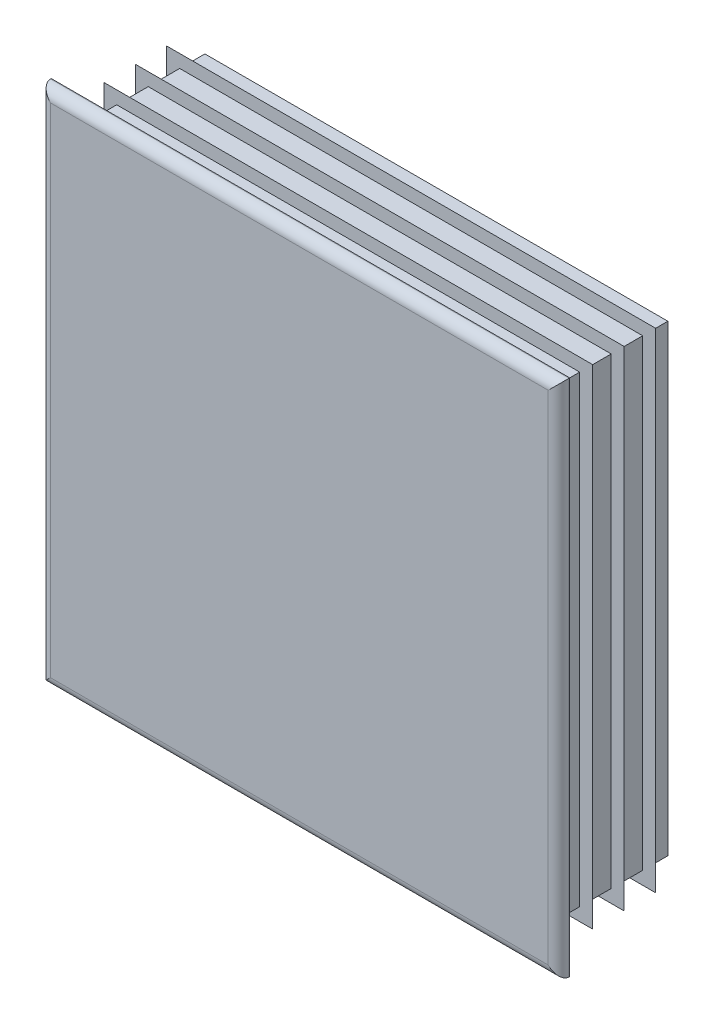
ISO-10303-21;
HEADER;
FILE_DESCRIPTION(('STEP AP214'),'2;1');
FILE_NAME('part.step','',(''),(''),'','','');
FILE_SCHEMA(('AUTOMOTIVE_DESIGN { 1 0 10303 214 1 1 1 1 }'));
ENDSEC;
DATA;
#1=APPLICATION_CONTEXT('core data for automotive mechanical design processes');
#2=APPLICATION_PROTOCOL_DEFINITION('international standard','automotive_design',2000,#1);
#3=PRODUCT_CONTEXT('',#1,'mechanical');
#4=PRODUCT('Part','Part','',(#3));
#5=PRODUCT_RELATED_PRODUCT_CATEGORY('part','',(#4));
#6=PRODUCT_DEFINITION_FORMATION('','',#4);
#7=PRODUCT_DEFINITION_CONTEXT('part definition',#1,'design');
#8=PRODUCT_DEFINITION('design','',#6,#7);
#9=PRODUCT_DEFINITION_SHAPE('','',#8);
#10=(LENGTH_UNIT() NAMED_UNIT(*) SI_UNIT(.MILLI.,.METRE.));
#11=(NAMED_UNIT(*) PLANE_ANGLE_UNIT() SI_UNIT($,.RADIAN.));
#12=(NAMED_UNIT(*) SI_UNIT($,.STERADIAN.) SOLID_ANGLE_UNIT());
#13=UNCERTAINTY_MEASURE_WITH_UNIT(LENGTH_MEASURE(1.E-05),#10,'distance_accuracy_value','');
#14=(GEOMETRIC_REPRESENTATION_CONTEXT(3) GLOBAL_UNCERTAINTY_ASSIGNED_CONTEXT((#13)) GLOBAL_UNIT_ASSIGNED_CONTEXT((#10,
#11,#12)) REPRESENTATION_CONTEXT('',''));
#15=CARTESIAN_POINT('',(0.,0.,0.));
#16=DIRECTION('',(0.,0.,1.));
#17=DIRECTION('',(1.,0.,0.));
#18=AXIS2_PLACEMENT_3D('',#15,#16,#17);
#19=CARTESIAN_POINT('',(67.2,-70.,3.));
#20=DIRECTION('',(0.,0.,-1.));
#21=DIRECTION('',(0.,1.,0.));
#22=AXIS2_PLACEMENT_3D('',#19,#20,#21);
#23=PLANE('',#22);
#24=DIRECTION('',(0.,1.,0.));
#25=VECTOR('',#24,1.);
#26=CARTESIAN_POINT('',(-67.2,-70.,3.));
#27=LINE('',#26,#25);
#28=CARTESIAN_POINT('',(-67.2,-67.2,3.));
#29=VERTEX_POINT('',#28);
#30=CARTESIAN_POINT('',(-67.2,67.2,3.));
#31=VERTEX_POINT('',#30);
#32=EDGE_CURVE('E262',#29,#31,#27,.T.);
#33=ORIENTED_EDGE('',*,*,#32,.F.);
#34=DIRECTION('',(-1.,0.,0.));
#35=VECTOR('',#34,1.);
#36=CARTESIAN_POINT('',(70.,-67.2,3.));
#37=LINE('',#36,#35);
#38=CARTESIAN_POINT('',(67.2,-67.2,3.));
#39=VERTEX_POINT('',#38);
#40=EDGE_CURVE('E432',#39,#29,#37,.T.);
#41=ORIENTED_EDGE('',*,*,#40,.F.);
#42=DIRECTION('',(0.,1.,0.));
#43=VECTOR('',#42,1.);
#44=CARTESIAN_POINT('',(67.2,-70.,3.));
#45=LINE('',#44,#43);
#46=CARTESIAN_POINT('',(67.2,67.2,3.));
#47=VERTEX_POINT('',#46);
#48=EDGE_CURVE('E257',#39,#47,#45,.T.);
#49=ORIENTED_EDGE('',*,*,#48,.T.);
#50=DIRECTION('',(-1.,0.,0.));
#51=VECTOR('',#50,1.);
#52=CARTESIAN_POINT('',(70.,67.2,3.));
#53=LINE('',#52,#51);
#54=EDGE_CURVE('E534',#47,#31,#53,.T.);
#55=ORIENTED_EDGE('',*,*,#54,.T.);
#56=EDGE_LOOP('',(#33,#41,#49,#55));
#57=FACE_BOUND('',#56,.T.);
#58=ADVANCED_FACE('F14',(#57),#23,.F.);
#59=CARTESIAN_POINT('',(-67.2,-70.,0.199999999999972));
#60=DIRECTION('',(0.,1.,0.));
#61=DIRECTION('',(-1.,0.,0.));
#62=AXIS2_PLACEMENT_3D('',#59,#60,#61);
#63=CYLINDRICAL_SURFACE('',#62,2.8);
#64=DIRECTION('',(0.,1.,0.));
#65=VECTOR('',#64,1.);
#66=CARTESIAN_POINT('',(-70.,-70.,0.2));
#67=LINE('',#66,#65);
#68=CARTESIAN_POINT('',(-70.,-70.,0.2));
#69=VERTEX_POINT('',#68);
#70=CARTESIAN_POINT('',(-70.,70.,0.2));
#71=VERTEX_POINT('',#70);
#72=EDGE_CURVE('E354',#69,#71,#67,.T.);
#73=ORIENTED_EDGE('',*,*,#72,.F.);
#74=CARTESIAN_POINT('',(-67.2,-67.2,0.199999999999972));
#75=DIRECTION('',(-0.707106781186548,0.707106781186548,0.));
#76=DIRECTION('',(0.707106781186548,0.707106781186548,0.));
#77=AXIS2_PLACEMENT_3D('',#74,#75,#76);
#78=ELLIPSE('',#77,3.9597979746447,2.8);
#79=EDGE_CURVE('E59',#69,#29,#78,.T.);
#80=ORIENTED_EDGE('',*,*,#79,.T.);
#81=ORIENTED_EDGE('',*,*,#32,.T.);
#82=CARTESIAN_POINT('',(-67.2,67.2,0.199999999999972));
#83=DIRECTION('',(0.707106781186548,0.707106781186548,0.));
#84=DIRECTION('',(-0.707106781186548,0.707106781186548,0.));
#85=AXIS2_PLACEMENT_3D('',#82,#83,#84);
#86=ELLIPSE('',#85,3.9597979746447,2.8);
#87=EDGE_CURVE('E258',#31,#71,#86,.F.);
#88=ORIENTED_EDGE('',*,*,#87,.T.);
#89=EDGE_LOOP('',(#73,#80,#81,#88));
#90=FACE_BOUND('',#89,.T.);
#91=ADVANCED_FACE('F16',(#90),#63,.T.);
#92=CARTESIAN_POINT('',(-70.,-70.,0.2));
#93=DIRECTION('',(1.,0.,0.));
#94=DIRECTION('',(0.,1.,0.));
#95=AXIS2_PLACEMENT_3D('',#92,#93,#94);
#96=PLANE('',#95);
#97=DIRECTION('',(0.,0.,-1.));
#98=VECTOR('',#97,1.);
#99=CARTESIAN_POINT('',(-70.,70.,0.2));
#100=LINE('',#99,#98);
#101=CARTESIAN_POINT('',(-70.,70.,0.));
#102=VERTEX_POINT('',#101);
#103=EDGE_CURVE('E519',#71,#102,#100,.T.);
#104=ORIENTED_EDGE('',*,*,#103,.T.);
#105=DIRECTION('',(0.,1.,0.));
#106=VECTOR('',#105,1.);
#107=CARTESIAN_POINT('',(-70.,-70.,0.));
#108=LINE('',#107,#106);
#109=CARTESIAN_POINT('',(-70.,-70.,0.));
#110=VERTEX_POINT('',#109);
#111=EDGE_CURVE('E352',#110,#102,#108,.T.);
#112=ORIENTED_EDGE('',*,*,#111,.F.);
#113=DIRECTION('',(0.,0.,-1.));
#114=VECTOR('',#113,1.);
#115=CARTESIAN_POINT('',(-70.,-70.,0.2));
#116=LINE('',#115,#114);
#117=EDGE_CURVE('E520',#69,#110,#116,.T.);
#118=ORIENTED_EDGE('',*,*,#117,.F.);
#119=ORIENTED_EDGE('',*,*,#72,.T.);
#120=EDGE_LOOP('',(#104,#112,#118,#119));
#121=FACE_BOUND('',#120,.T.);
#122=ADVANCED_FACE('F604',(#121),#96,.F.);
#123=CARTESIAN_POINT('',(-62.5,-70.,0.));
#124=DIRECTION('',(1.,0.,0.));
#125=DIRECTION('',(0.,1.,0.));
#126=AXIS2_PLACEMENT_3D('',#123,#124,#125);
#127=PLANE('',#126);
#128=DIRECTION('',(0.,1.,0.));
#129=VECTOR('',#128,1.);
#130=CARTESIAN_POINT('',(-62.5,-70.,0.));
#131=LINE('',#130,#129);
#132=CARTESIAN_POINT('',(-62.5,-62.5,0.));
#133=VERTEX_POINT('',#132);
#134=CARTESIAN_POINT('',(-62.5,62.5,0.));
#135=VERTEX_POINT('',#134);
#136=EDGE_CURVE('E349',#133,#135,#131,.T.);
#137=ORIENTED_EDGE('',*,*,#136,.T.);
#138=DIRECTION('',(0.,0.,-1.));
#139=VECTOR('',#138,1.);
#140=CARTESIAN_POINT('',(-62.5,62.5,0.));
#141=LINE('',#140,#139);
#142=CARTESIAN_POINT('',(-62.5,62.5,-1.7));
#143=VERTEX_POINT('',#142);
#144=EDGE_CURVE('E445',#135,#143,#141,.T.);
#145=ORIENTED_EDGE('',*,*,#144,.T.);
#146=DIRECTION('',(0.,1.,0.));
#147=VECTOR('',#146,1.);
#148=CARTESIAN_POINT('',(-62.5,-70.,-1.7));
#149=LINE('',#148,#147);
#150=CARTESIAN_POINT('',(-62.5,-62.5,-1.7));
#151=VERTEX_POINT('',#150);
#152=EDGE_CURVE('E346',#151,#143,#149,.T.);
#153=ORIENTED_EDGE('',*,*,#152,.F.);
#154=DIRECTION('',(0.,0.,1.));
#155=VECTOR('',#154,1.);
#156=CARTESIAN_POINT('',(-62.5,-62.5,0.));
#157=LINE('',#156,#155);
#158=EDGE_CURVE('E439',#151,#133,#157,.T.);
#159=ORIENTED_EDGE('',*,*,#158,.T.);
#160=EDGE_LOOP('',(#137,#145,#153,#159));
#161=FACE_BOUND('',#160,.T.);
#162=ADVANCED_FACE('F728',(#161),#127,.F.);
#163=CARTESIAN_POINT('',(-66.,-70.,-1.7));
#164=DIRECTION('',(0.573576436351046,0.,0.819152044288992));
#165=DIRECTION('',(-0.819152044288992,0.,0.573576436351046));
#166=AXIS2_PLACEMENT_3D('',#163,#164,#165);
#167=PLANE('',#166);
#168=DIRECTION('',(0.,1.,0.));
#169=VECTOR('',#168,1.);
#170=CARTESIAN_POINT('',(-66.,-70.,-1.7));
#171=LINE('',#170,#169);
#172=CARTESIAN_POINT('',(-66.,-66.,-1.7));
#173=VERTEX_POINT('',#172);
#174=CARTESIAN_POINT('',(-66.,66.,-1.7));
#175=VERTEX_POINT('',#174);
#176=EDGE_CURVE('E344',#173,#175,#171,.T.);
#177=ORIENTED_EDGE('',*,*,#176,.T.);
#178=DIRECTION('',(0.633687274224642,-0.633687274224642,-0.443712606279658));
#179=VECTOR('',#178,1.);
#180=CARTESIAN_POINT('',(-11.3878996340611,11.3878996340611,-39.9398043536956));
#181=LINE('',#180,#179);
#182=CARTESIAN_POINT('',(-62.5,62.5,-4.15072638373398));
#183=VERTEX_POINT('',#182);
#184=EDGE_CURVE('E457',#175,#183,#181,.T.);
#185=ORIENTED_EDGE('',*,*,#184,.T.);
#186=DIRECTION('',(0.,1.,0.));
#187=VECTOR('',#186,1.);
#188=CARTESIAN_POINT('',(-62.5,-70.,-4.15072638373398));
#189=LINE('',#188,#187);
#190=CARTESIAN_POINT('',(-62.5,-62.5,-4.15072638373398));
#191=VERTEX_POINT('',#190);
#192=EDGE_CURVE('E341',#191,#183,#189,.T.);
#193=ORIENTED_EDGE('',*,*,#192,.F.);
#194=DIRECTION('',(-0.633687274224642,-0.633687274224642,0.443712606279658));
#195=VECTOR('',#194,1.);
#196=CARTESIAN_POINT('',(-67.606238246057,-67.606238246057,-0.575299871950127));
#197=LINE('',#196,#195);
#198=EDGE_CURVE('E451',#191,#173,#197,.T.);
#199=ORIENTED_EDGE('',*,*,#198,.T.);
#200=EDGE_LOOP('',(#177,#185,#193,#199));
#201=FACE_BOUND('',#200,.T.);
#202=ADVANCED_FACE('F732',(#201),#167,.F.);
#203=CARTESIAN_POINT('',(-62.5,-70.,-4.15072638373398));
#204=DIRECTION('',(1.,0.,0.));
#205=DIRECTION('',(0.,1.,0.));
#206=AXIS2_PLACEMENT_3D('',#203,#204,#205);
#207=PLANE('',#206);
#208=ORIENTED_EDGE('',*,*,#192,.T.);
#209=DIRECTION('',(0.,0.,-1.));
#210=VECTOR('',#209,1.);
#211=CARTESIAN_POINT('',(-62.5,62.5,-4.15072638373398));
#212=LINE('',#211,#210);
#213=CARTESIAN_POINT('',(-62.5,62.5,-10.2));
#214=VERTEX_POINT('',#213);
#215=EDGE_CURVE('E463',#183,#214,#212,.T.);
#216=ORIENTED_EDGE('',*,*,#215,.T.);
#217=DIRECTION('',(0.,1.,0.));
#218=VECTOR('',#217,1.);
#219=CARTESIAN_POINT('',(-62.5,-70.,-10.2));
#220=LINE('',#219,#218);
#221=CARTESIAN_POINT('',(-62.5,-62.5,-10.2));
#222=VERTEX_POINT('',#221);
#223=EDGE_CURVE('E338',#222,#214,#220,.T.);
#224=ORIENTED_EDGE('',*,*,#223,.F.);
#225=DIRECTION('',(0.,0.,1.));
#226=VECTOR('',#225,1.);
#227=CARTESIAN_POINT('',(-62.5,-62.5,-4.15072638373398));
#228=LINE('',#227,#226);
#229=EDGE_CURVE('E460',#222,#191,#228,.T.);
#230=ORIENTED_EDGE('',*,*,#229,.T.);
#231=EDGE_LOOP('',(#208,#216,#224,#230));
#232=FACE_BOUND('',#231,.T.);
#233=ADVANCED_FACE('F738',(#232),#207,.F.);
#234=CARTESIAN_POINT('',(-66.,-70.,-10.2));
#235=DIRECTION('',(0.573576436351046,0.,0.819152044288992));
#236=DIRECTION('',(-0.819152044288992,0.,0.573576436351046));
#237=AXIS2_PLACEMENT_3D('',#234,#235,#236);
#238=PLANE('',#237);
#239=DIRECTION('',(0.,1.,0.));
#240=VECTOR('',#239,1.);
#241=CARTESIAN_POINT('',(-66.,-70.,-10.2));
#242=LINE('',#241,#240);
#243=CARTESIAN_POINT('',(-66.,-66.,-10.2));
#244=VERTEX_POINT('',#243);
#245=CARTESIAN_POINT('',(-66.,66.,-10.2));
#246=VERTEX_POINT('',#245);
#247=EDGE_CURVE('E336',#244,#246,#242,.T.);
#248=ORIENTED_EDGE('',*,*,#247,.T.);
#249=DIRECTION('',(0.633687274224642,-0.633687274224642,-0.443712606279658));
#250=VECTOR('',#249,1.);
#251=CARTESIAN_POINT('',(-11.3878996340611,11.3878996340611,-48.4398043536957));
#252=LINE('',#251,#250);
#253=CARTESIAN_POINT('',(-62.5,62.5,-12.650726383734));
#254=VERTEX_POINT('',#253);
#255=EDGE_CURVE('E475',#246,#254,#252,.T.);
#256=ORIENTED_EDGE('',*,*,#255,.T.);
#257=DIRECTION('',(0.,1.,0.));
#258=VECTOR('',#257,1.);
#259=CARTESIAN_POINT('',(-62.5,-70.,-12.650726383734));
#260=LINE('',#259,#258);
#261=CARTESIAN_POINT('',(-62.5,-62.5,-12.650726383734));
#262=VERTEX_POINT('',#261);
#263=EDGE_CURVE('E333',#262,#254,#260,.T.);
#264=ORIENTED_EDGE('',*,*,#263,.F.);
#265=DIRECTION('',(-0.633687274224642,-0.633687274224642,0.443712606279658));
#266=VECTOR('',#265,1.);
#267=CARTESIAN_POINT('',(-67.606238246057,-67.606238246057,-9.07529987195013));
#268=LINE('',#267,#266);
#269=EDGE_CURVE('E469',#262,#244,#268,.T.);
#270=ORIENTED_EDGE('',*,*,#269,.T.);
#271=EDGE_LOOP('',(#248,#256,#264,#270));
#272=FACE_BOUND('',#271,.T.);
#273=ADVANCED_FACE('F742',(#272),#238,.F.);
#274=CARTESIAN_POINT('',(-62.5,-70.,-12.650726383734));
#275=DIRECTION('',(1.,0.,0.));
#276=DIRECTION('',(0.,1.,0.));
#277=AXIS2_PLACEMENT_3D('',#274,#275,#276);
#278=PLANE('',#277);
#279=ORIENTED_EDGE('',*,*,#263,.T.);
#280=DIRECTION('',(0.,0.,-1.));
#281=VECTOR('',#280,1.);
#282=CARTESIAN_POINT('',(-62.5,62.5,-12.650726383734));
#283=LINE('',#282,#281);
#284=CARTESIAN_POINT('',(-62.5,62.5,-18.7));
#285=VERTEX_POINT('',#284);
#286=EDGE_CURVE('E481',#254,#285,#283,.T.);
#287=ORIENTED_EDGE('',*,*,#286,.T.);
#288=DIRECTION('',(0.,1.,0.));
#289=VECTOR('',#288,1.);
#290=CARTESIAN_POINT('',(-62.5,-70.,-18.7));
#291=LINE('',#290,#289);
#292=CARTESIAN_POINT('',(-62.5,-62.5,-18.7));
#293=VERTEX_POINT('',#292);
#294=EDGE_CURVE('E330',#293,#285,#291,.T.);
#295=ORIENTED_EDGE('',*,*,#294,.F.);
#296=DIRECTION('',(0.,0.,1.));
#297=VECTOR('',#296,1.);
#298=CARTESIAN_POINT('',(-62.5,-62.5,-12.650726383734));
#299=LINE('',#298,#297);
#300=EDGE_CURVE('E478',#293,#262,#299,.T.);
#301=ORIENTED_EDGE('',*,*,#300,.T.);
#302=EDGE_LOOP('',(#279,#287,#295,#301));
#303=FACE_BOUND('',#302,.T.);
#304=ADVANCED_FACE('F746',(#303),#278,.F.);
#305=CARTESIAN_POINT('',(-66.,-70.,-18.7));
#306=DIRECTION('',(0.573576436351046,0.,0.819152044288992));
#307=DIRECTION('',(-0.819152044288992,0.,0.573576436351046));
#308=AXIS2_PLACEMENT_3D('',#305,#306,#307);
#309=PLANE('',#308);
#310=DIRECTION('',(0.,1.,0.));
#311=VECTOR('',#310,1.);
#312=CARTESIAN_POINT('',(-66.,-70.,-18.7));
#313=LINE('',#312,#311);
#314=CARTESIAN_POINT('',(-66.,-66.,-18.7));
#315=VERTEX_POINT('',#314);
#316=CARTESIAN_POINT('',(-66.,66.,-18.7));
#317=VERTEX_POINT('',#316);
#318=EDGE_CURVE('E328',#315,#317,#313,.T.);
#319=ORIENTED_EDGE('',*,*,#318,.T.);
#320=DIRECTION('',(0.633687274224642,-0.633687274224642,-0.443712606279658));
#321=VECTOR('',#320,1.);
#322=CARTESIAN_POINT('',(-11.3878996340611,11.3878996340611,-56.9398043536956));
#323=LINE('',#322,#321);
#324=CARTESIAN_POINT('',(-62.5,62.5,-21.150726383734));
#325=VERTEX_POINT('',#324);
#326=EDGE_CURVE('E493',#317,#325,#323,.T.);
#327=ORIENTED_EDGE('',*,*,#326,.T.);
#328=DIRECTION('',(0.,1.,0.));
#329=VECTOR('',#328,1.);
#330=CARTESIAN_POINT('',(-62.5,-70.,-21.150726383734));
#331=LINE('',#330,#329);
#332=CARTESIAN_POINT('',(-62.5,-62.5,-21.150726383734));
#333=VERTEX_POINT('',#332);
#334=EDGE_CURVE('E325',#333,#325,#331,.T.);
#335=ORIENTED_EDGE('',*,*,#334,.F.);
#336=DIRECTION('',(-0.633687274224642,-0.633687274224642,0.443712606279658));
#337=VECTOR('',#336,1.);
#338=CARTESIAN_POINT('',(-67.606238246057,-67.606238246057,-17.5752998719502));
#339=LINE('',#338,#337);
#340=EDGE_CURVE('E487',#333,#315,#339,.T.);
#341=ORIENTED_EDGE('',*,*,#340,.T.);
#342=EDGE_LOOP('',(#319,#327,#335,#341));
#343=FACE_BOUND('',#342,.T.);
#344=ADVANCED_FACE('F668',(#343),#309,.F.);
#345=CARTESIAN_POINT('',(-62.5,-70.,-21.150726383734));
#346=DIRECTION('',(1.,0.,0.));
#347=DIRECTION('',(0.,1.,0.));
#348=AXIS2_PLACEMENT_3D('',#345,#346,#347);
#349=PLANE('',#348);
#350=ORIENTED_EDGE('',*,*,#334,.T.);
#351=DIRECTION('',(0.,0.,-1.));
#352=VECTOR('',#351,1.);
#353=CARTESIAN_POINT('',(-62.5,62.5,-21.150726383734));
#354=LINE('',#353,#352);
#355=CARTESIAN_POINT('',(-62.5,62.5,-27.2));
#356=VERTEX_POINT('',#355);
#357=EDGE_CURVE('E499',#325,#356,#354,.T.);
#358=ORIENTED_EDGE('',*,*,#357,.T.);
#359=DIRECTION('',(0.,1.,0.));
#360=VECTOR('',#359,1.);
#361=CARTESIAN_POINT('',(-62.5,-70.,-27.2));
#362=LINE('',#361,#360);
#363=CARTESIAN_POINT('',(-62.5,-62.5,-27.2));
#364=VERTEX_POINT('',#363);
#365=EDGE_CURVE('E322',#364,#356,#362,.T.);
#366=ORIENTED_EDGE('',*,*,#365,.F.);
#367=DIRECTION('',(0.,0.,1.));
#368=VECTOR('',#367,1.);
#369=CARTESIAN_POINT('',(-62.5,-62.5,-21.150726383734));
#370=LINE('',#369,#368);
#371=EDGE_CURVE('E496',#364,#333,#370,.T.);
#372=ORIENTED_EDGE('',*,*,#371,.T.);
#373=EDGE_LOOP('',(#350,#358,#366,#372));
#374=FACE_BOUND('',#373,.T.);
#375=ADVANCED_FACE('F665',(#374),#349,.F.);
#376=CARTESIAN_POINT('',(-66.,-70.,-27.2));
#377=DIRECTION('',(0.573576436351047,0.,0.819152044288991));
#378=DIRECTION('',(-0.819152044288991,0.,0.573576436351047));
#379=AXIS2_PLACEMENT_3D('',#376,#377,#378);
#380=PLANE('',#379);
#381=DIRECTION('',(0.,1.,0.));
#382=VECTOR('',#381,1.);
#383=CARTESIAN_POINT('',(-66.,-70.,-27.2));
#384=LINE('',#383,#382);
#385=CARTESIAN_POINT('',(-66.,-66.,-27.2));
#386=VERTEX_POINT('',#385);
#387=CARTESIAN_POINT('',(-66.,66.,-27.2));
#388=VERTEX_POINT('',#387);
#389=EDGE_CURVE('E320',#386,#388,#384,.T.);
#390=ORIENTED_EDGE('',*,*,#389,.T.);
#391=DIRECTION('',(0.633687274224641,-0.633687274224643,-0.443712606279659));
#392=VECTOR('',#391,1.);
#393=CARTESIAN_POINT('',(-11.3878996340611,11.3878996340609,-65.4398043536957));
#394=LINE('',#393,#392);
#395=CARTESIAN_POINT('',(-62.5,62.5,-29.650726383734));
#396=VERTEX_POINT('',#395);
#397=EDGE_CURVE('E511',#388,#396,#394,.T.);
#398=ORIENTED_EDGE('',*,*,#397,.T.);
#399=DIRECTION('',(0.,1.,0.));
#400=VECTOR('',#399,1.);
#401=CARTESIAN_POINT('',(-62.5,-70.,-29.650726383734));
#402=LINE('',#401,#400);
#403=CARTESIAN_POINT('',(-62.5,-62.5,-29.650726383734));
#404=VERTEX_POINT('',#403);
#405=EDGE_CURVE('E317',#404,#396,#402,.T.);
#406=ORIENTED_EDGE('',*,*,#405,.F.);
#407=DIRECTION('',(-0.633687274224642,-0.633687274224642,0.443712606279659));
#408=VECTOR('',#407,1.);
#409=CARTESIAN_POINT('',(-67.606238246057,-67.606238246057,-26.0752998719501));
#410=LINE('',#409,#408);
#411=EDGE_CURVE('E505',#404,#386,#410,.T.);
#412=ORIENTED_EDGE('',*,*,#411,.T.);
#413=EDGE_LOOP('',(#390,#398,#406,#412));
#414=FACE_BOUND('',#413,.T.);
#415=ADVANCED_FACE('F580',(#414),#380,.F.);
#416=CARTESIAN_POINT('',(-62.5,-70.,-29.650726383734));
#417=DIRECTION('',(1.,0.,0.));
#418=DIRECTION('',(0.,1.,0.));
#419=AXIS2_PLACEMENT_3D('',#416,#417,#418);
#420=PLANE('',#419);
#421=ORIENTED_EDGE('',*,*,#405,.T.);
#422=DIRECTION('',(0.,0.,-1.));
#423=VECTOR('',#422,1.);
#424=CARTESIAN_POINT('',(-62.5,62.5,-29.650726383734));
#425=LINE('',#424,#423);
#426=CARTESIAN_POINT('',(-62.5,62.5,-34.));
#427=VERTEX_POINT('',#426);
#428=EDGE_CURVE('E517',#396,#427,#425,.T.);
#429=ORIENTED_EDGE('',*,*,#428,.T.);
#430=DIRECTION('',(0.,1.,0.));
#431=VECTOR('',#430,1.);
#432=CARTESIAN_POINT('',(-62.5,-70.,-34.));
#433=LINE('',#432,#431);
#434=CARTESIAN_POINT('',(-62.5,-62.5,-34.));
#435=VERTEX_POINT('',#434);
#436=EDGE_CURVE('E314',#435,#427,#433,.T.);
#437=ORIENTED_EDGE('',*,*,#436,.F.);
#438=DIRECTION('',(0.,0.,1.));
#439=VECTOR('',#438,1.);
#440=CARTESIAN_POINT('',(-62.5,-62.5,-29.650726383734));
#441=LINE('',#440,#439);
#442=EDGE_CURVE('E514',#435,#404,#441,.T.);
#443=ORIENTED_EDGE('',*,*,#442,.T.);
#444=EDGE_LOOP('',(#421,#429,#437,#443));
#445=FACE_BOUND('',#444,.T.);
#446=ADVANCED_FACE('F582',(#445),#420,.F.);
#447=CARTESIAN_POINT('',(-62.5,-70.,-34.));
#448=DIRECTION('',(0.,0.,1.));
#449=DIRECTION('',(0.,-1.,0.));
#450=AXIS2_PLACEMENT_3D('',#447,#448,#449);
#451=PLANE('',#450);
#452=ORIENTED_EDGE('',*,*,#436,.T.);
#453=DIRECTION('',(-1.,0.,0.));
#454=VECTOR('',#453,1.);
#455=CARTESIAN_POINT('',(70.,62.5,-34.));
#456=LINE('',#455,#454);
#457=CARTESIAN_POINT('',(62.5,62.5,-34.));
#458=VERTEX_POINT('',#457);
#459=EDGE_CURVE('E388',#458,#427,#456,.T.);
#460=ORIENTED_EDGE('',*,*,#459,.F.);
#461=DIRECTION('',(0.,1.,0.));
#462=VECTOR('',#461,1.);
#463=CARTESIAN_POINT('',(62.5,-70.,-34.));
#464=LINE('',#463,#462);
#465=CARTESIAN_POINT('',(62.5,-62.5,-34.));
#466=VERTEX_POINT('',#465);
#467=EDGE_CURVE('E311',#466,#458,#464,.T.);
#468=ORIENTED_EDGE('',*,*,#467,.F.);
#469=DIRECTION('',(-1.,0.,0.));
#470=VECTOR('',#469,1.);
#471=CARTESIAN_POINT('',(70.,-62.5,-34.));
#472=LINE('',#471,#470);
#473=EDGE_CURVE('E386',#466,#435,#472,.T.);
#474=ORIENTED_EDGE('',*,*,#473,.T.);
#475=EDGE_LOOP('',(#452,#460,#468,#474));
#476=FACE_BOUND('',#475,.T.);
#477=ADVANCED_FACE('F385',(#476),#451,.F.);
#478=CARTESIAN_POINT('',(62.5,-70.,-34.));
#479=DIRECTION('',(-1.,0.,0.));
#480=DIRECTION('',(0.,-1.,0.));
#481=AXIS2_PLACEMENT_3D('',#478,#479,#480);
#482=PLANE('',#481);
#483=ORIENTED_EDGE('',*,*,#467,.T.);
#484=DIRECTION('',(0.,0.,1.));
#485=VECTOR('',#484,1.);
#486=CARTESIAN_POINT('',(62.5,62.5,-34.));
#487=LINE('',#486,#485);
#488=CARTESIAN_POINT('',(62.5,62.5,-29.650726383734));
#489=VERTEX_POINT('',#488);
#490=EDGE_CURVE('E9',#458,#489,#487,.T.);
#491=ORIENTED_EDGE('',*,*,#490,.T.);
#492=DIRECTION('',(0.,1.,0.));
#493=VECTOR('',#492,1.);
#494=CARTESIAN_POINT('',(62.5,-70.,-29.650726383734));
#495=LINE('',#494,#493);
#496=CARTESIAN_POINT('',(62.5,-62.5,-29.650726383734));
#497=VERTEX_POINT('',#496);
#498=EDGE_CURVE('E308',#497,#489,#495,.T.);
#499=ORIENTED_EDGE('',*,*,#498,.F.);
#500=DIRECTION('',(0.,0.,-1.));
#501=VECTOR('',#500,1.);
#502=CARTESIAN_POINT('',(62.5,-62.5,-34.));
#503=LINE('',#502,#501);
#504=EDGE_CURVE('E23',#497,#466,#503,.T.);
#505=ORIENTED_EDGE('',*,*,#504,.T.);
#506=EDGE_LOOP('',(#483,#491,#499,#505));
#507=FACE_BOUND('',#506,.T.);
#508=ADVANCED_FACE('F378',(#507),#482,.F.);
#509=CARTESIAN_POINT('',(62.5,-70.,-29.650726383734));
#510=DIRECTION('',(-0.573576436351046,0.,0.819152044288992));
#511=DIRECTION('',(-0.819152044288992,0.,-0.573576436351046));
#512=AXIS2_PLACEMENT_3D('',#509,#510,#511);
#513=PLANE('',#512);
#514=ORIENTED_EDGE('',*,*,#498,.T.);
#515=DIRECTION('',(0.633687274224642,0.633687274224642,0.443712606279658));
#516=VECTOR('',#515,1.);
#517=CARTESIAN_POINT('',(9.29335809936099,9.29335809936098,-66.906418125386));
#518=LINE('',#517,#516);
#519=CARTESIAN_POINT('',(66.,66.,-27.2));
#520=VERTEX_POINT('',#519);
#521=EDGE_CURVE('E508',#489,#520,#518,.T.);
#522=ORIENTED_EDGE('',*,*,#521,.T.);
#523=DIRECTION('',(0.,1.,0.));
#524=VECTOR('',#523,1.);
#525=CARTESIAN_POINT('',(66.,-70.,-27.2));
#526=LINE('',#525,#524);
#527=CARTESIAN_POINT('',(66.,-66.,-27.2));
#528=VERTEX_POINT('',#527);
#529=EDGE_CURVE('E305',#528,#520,#526,.T.);
#530=ORIENTED_EDGE('',*,*,#529,.F.);
#531=DIRECTION('',(-0.633687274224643,0.633687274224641,-0.443712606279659));
#532=VECTOR('',#531,1.);
#533=CARTESIAN_POINT('',(65.5116967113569,-65.5116967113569,-27.5419136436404));
#534=LINE('',#533,#532);
#535=EDGE_CURVE('E502',#528,#497,#534,.T.);
#536=ORIENTED_EDGE('',*,*,#535,.T.);
#537=EDGE_LOOP('',(#514,#522,#530,#536));
#538=FACE_BOUND('',#537,.T.);
#539=ADVANCED_FACE('F588',(#538),#513,.F.);
#540=CARTESIAN_POINT('',(66.,-70.,-27.2));
#541=DIRECTION('',(0.,0.,-1.));
#542=DIRECTION('',(0.,1.,0.));
#543=AXIS2_PLACEMENT_3D('',#540,#541,#542);
#544=PLANE('',#543);
#545=ORIENTED_EDGE('',*,*,#529,.T.);
#546=DIRECTION('',(-1.,0.,0.));
#547=VECTOR('',#546,1.);
#548=CARTESIAN_POINT('',(70.,66.,-27.2));
#549=LINE('',#548,#547);
#550=EDGE_CURVE('E394',#520,#388,#549,.T.);
#551=ORIENTED_EDGE('',*,*,#550,.T.);
#552=ORIENTED_EDGE('',*,*,#389,.F.);
#553=DIRECTION('',(-1.,0.,0.));
#554=VECTOR('',#553,1.);
#555=CARTESIAN_POINT('',(70.,-66.,-27.2));
#556=LINE('',#555,#554);
#557=EDGE_CURVE('E401',#528,#386,#556,.T.);
#558=ORIENTED_EDGE('',*,*,#557,.F.);
#559=EDGE_LOOP('',(#545,#551,#552,#558));
#560=FACE_BOUND('',#559,.T.);
#561=ORIENTED_EDGE('',*,*,#365,.T.);
#562=DIRECTION('',(-1.,0.,0.));
#563=VECTOR('',#562,1.);
#564=CARTESIAN_POINT('',(70.,62.5,-27.2));
#565=LINE('',#564,#563);
#566=CARTESIAN_POINT('',(62.5,62.5,-27.2));
#567=VERTEX_POINT('',#566);
#568=EDGE_CURVE('E567',#567,#356,#565,.T.);
#569=ORIENTED_EDGE('',*,*,#568,.F.);
#570=DIRECTION('',(0.,1.,0.));
#571=VECTOR('',#570,1.);
#572=CARTESIAN_POINT('',(62.5,-70.,-27.2));
#573=LINE('',#572,#571);
#574=CARTESIAN_POINT('',(62.5,-62.5,-27.2));
#575=VERTEX_POINT('',#574);
#576=EDGE_CURVE('E302',#575,#567,#573,.T.);
#577=ORIENTED_EDGE('',*,*,#576,.F.);
#578=DIRECTION('',(-1.,0.,0.));
#579=VECTOR('',#578,1.);
#580=CARTESIAN_POINT('',(70.,-62.5,-27.2));
#581=LINE('',#580,#579);
#582=EDGE_CURVE('E403',#575,#364,#581,.T.);
#583=ORIENTED_EDGE('',*,*,#582,.T.);
#584=EDGE_LOOP('',(#561,#569,#577,#583));
#585=FACE_BOUND('',#584,.T.);
#586=ADVANCED_FACE('F571',(#560,#585),#544,.F.);
#587=CARTESIAN_POINT('',(62.5,-70.,-27.2));
#588=DIRECTION('',(-1.,0.,0.));
#589=DIRECTION('',(0.,-1.,0.));
#590=AXIS2_PLACEMENT_3D('',#587,#588,#589);
#591=PLANE('',#590);
#592=ORIENTED_EDGE('',*,*,#576,.T.);
#593=DIRECTION('',(0.,0.,1.));
#594=VECTOR('',#593,1.);
#595=CARTESIAN_POINT('',(62.5,62.5,-27.2));
#596=LINE('',#595,#594);
#597=CARTESIAN_POINT('',(62.5,62.5,-21.150726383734));
#598=VERTEX_POINT('',#597);
#599=EDGE_CURVE('E372',#567,#598,#596,.T.);
#600=ORIENTED_EDGE('',*,*,#599,.T.);
#601=DIRECTION('',(0.,1.,0.));
#602=VECTOR('',#601,1.);
#603=CARTESIAN_POINT('',(62.5,-70.,-21.150726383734));
#604=LINE('',#603,#602);
#605=CARTESIAN_POINT('',(62.5,-62.5,-21.150726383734));
#606=VERTEX_POINT('',#605);
#607=EDGE_CURVE('E299',#606,#598,#604,.T.);
#608=ORIENTED_EDGE('',*,*,#607,.F.);
#609=DIRECTION('',(0.,0.,-1.));
#610=VECTOR('',#609,1.);
#611=CARTESIAN_POINT('',(62.5,-62.5,-27.2));
#612=LINE('',#611,#610);
#613=EDGE_CURVE('E369',#606,#575,#612,.T.);
#614=ORIENTED_EDGE('',*,*,#613,.T.);
#615=EDGE_LOOP('',(#592,#600,#608,#614));
#616=FACE_BOUND('',#615,.T.);
#617=ADVANCED_FACE('F596',(#616),#591,.F.);
#618=CARTESIAN_POINT('',(62.5,-70.,-21.150726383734));
#619=DIRECTION('',(-0.573576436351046,0.,0.819152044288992));
#620=DIRECTION('',(-0.819152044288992,0.,-0.573576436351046));
#621=AXIS2_PLACEMENT_3D('',#618,#619,#620);
#622=PLANE('',#621);
#623=ORIENTED_EDGE('',*,*,#607,.T.);
#624=DIRECTION('',(0.633687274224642,0.633687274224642,0.443712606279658));
#625=VECTOR('',#624,1.);
#626=CARTESIAN_POINT('',(9.29335809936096,9.29335809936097,-58.406418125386));
#627=LINE('',#626,#625);
#628=CARTESIAN_POINT('',(66.,66.,-18.7));
#629=VERTEX_POINT('',#628);
#630=EDGE_CURVE('E490',#598,#629,#627,.T.);
#631=ORIENTED_EDGE('',*,*,#630,.T.);
#632=DIRECTION('',(0.,1.,0.));
#633=VECTOR('',#632,1.);
#634=CARTESIAN_POINT('',(66.,-70.,-18.7));
#635=LINE('',#634,#633);
#636=CARTESIAN_POINT('',(66.,-66.,-18.7));
#637=VERTEX_POINT('',#636);
#638=EDGE_CURVE('E296',#637,#629,#635,.T.);
#639=ORIENTED_EDGE('',*,*,#638,.F.);
#640=DIRECTION('',(-0.633687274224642,0.633687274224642,-0.443712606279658));
#641=VECTOR('',#640,1.);
#642=CARTESIAN_POINT('',(65.5116967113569,-65.5116967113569,-19.0419136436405));
#643=LINE('',#642,#641);
#644=EDGE_CURVE('E484',#637,#606,#643,.T.);
#645=ORIENTED_EDGE('',*,*,#644,.T.);
#646=EDGE_LOOP('',(#623,#631,#639,#645));
#647=FACE_BOUND('',#646,.T.);
#648=ADVANCED_FACE('F648',(#647),#622,.F.);
#649=CARTESIAN_POINT('',(66.,-70.,-18.7));
#650=DIRECTION('',(0.,0.,-1.));
#651=DIRECTION('',(0.,1.,0.));
#652=AXIS2_PLACEMENT_3D('',#649,#650,#651);
#653=PLANE('',#652);
#654=ORIENTED_EDGE('',*,*,#638,.T.);
#655=DIRECTION('',(-1.,0.,0.));
#656=VECTOR('',#655,1.);
#657=CARTESIAN_POINT('',(70.,66.,-18.7));
#658=LINE('',#657,#656);
#659=EDGE_CURVE('E561',#629,#317,#658,.T.);
#660=ORIENTED_EDGE('',*,*,#659,.T.);
#661=ORIENTED_EDGE('',*,*,#318,.F.);
#662=DIRECTION('',(-1.,0.,0.));
#663=VECTOR('',#662,1.);
#664=CARTESIAN_POINT('',(70.,-66.,-18.7));
#665=LINE('',#664,#663);
#666=EDGE_CURVE('E409',#637,#315,#665,.T.);
#667=ORIENTED_EDGE('',*,*,#666,.F.);
#668=EDGE_LOOP('',(#654,#660,#661,#667));
#669=FACE_BOUND('',#668,.T.);
#670=ORIENTED_EDGE('',*,*,#294,.T.);
#671=DIRECTION('',(-1.,0.,0.));
#672=VECTOR('',#671,1.);
#673=CARTESIAN_POINT('',(70.,62.5,-18.7));
#674=LINE('',#673,#672);
#675=CARTESIAN_POINT('',(62.5,62.5,-18.7));
#676=VERTEX_POINT('',#675);
#677=EDGE_CURVE('E559',#676,#285,#674,.T.);
#678=ORIENTED_EDGE('',*,*,#677,.F.);
#679=DIRECTION('',(0.,1.,0.));
#680=VECTOR('',#679,1.);
#681=CARTESIAN_POINT('',(62.5,-70.,-18.7));
#682=LINE('',#681,#680);
#683=CARTESIAN_POINT('',(62.5,-62.5,-18.7));
#684=VERTEX_POINT('',#683);
#685=EDGE_CURVE('E293',#684,#676,#682,.T.);
#686=ORIENTED_EDGE('',*,*,#685,.F.);
#687=DIRECTION('',(-1.,0.,0.));
#688=VECTOR('',#687,1.);
#689=CARTESIAN_POINT('',(70.,-62.5,-18.7));
#690=LINE('',#689,#688);
#691=EDGE_CURVE('E411',#684,#293,#690,.T.);
#692=ORIENTED_EDGE('',*,*,#691,.T.);
#693=EDGE_LOOP('',(#670,#678,#686,#692));
#694=FACE_BOUND('',#693,.T.);
#695=ADVANCED_FACE('F644',(#669,#694),#653,.F.);
#696=CARTESIAN_POINT('',(62.5,-70.,-18.7));
#697=DIRECTION('',(-1.,0.,0.));
#698=DIRECTION('',(0.,-1.,0.));
#699=AXIS2_PLACEMENT_3D('',#696,#697,#698);
#700=PLANE('',#699);
#701=ORIENTED_EDGE('',*,*,#685,.T.);
#702=DIRECTION('',(0.,0.,1.));
#703=VECTOR('',#702,1.);
#704=CARTESIAN_POINT('',(62.5,62.5,-18.7));
#705=LINE('',#704,#703);
#706=CARTESIAN_POINT('',(62.5,62.5,-12.650726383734));
#707=VERTEX_POINT('',#706);
#708=EDGE_CURVE('E366',#676,#707,#705,.T.);
#709=ORIENTED_EDGE('',*,*,#708,.T.);
#710=DIRECTION('',(0.,1.,0.));
#711=VECTOR('',#710,1.);
#712=CARTESIAN_POINT('',(62.5,-70.,-12.650726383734));
#713=LINE('',#712,#711);
#714=CARTESIAN_POINT('',(62.5,-62.5,-12.650726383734));
#715=VERTEX_POINT('',#714);
#716=EDGE_CURVE('E290',#715,#707,#713,.T.);
#717=ORIENTED_EDGE('',*,*,#716,.F.);
#718=DIRECTION('',(0.,0.,-1.));
#719=VECTOR('',#718,1.);
#720=CARTESIAN_POINT('',(62.5,-62.5,-18.7));
#721=LINE('',#720,#719);
#722=EDGE_CURVE('E363',#715,#684,#721,.T.);
#723=ORIENTED_EDGE('',*,*,#722,.T.);
#724=EDGE_LOOP('',(#701,#709,#717,#723));
#725=FACE_BOUND('',#724,.T.);
#726=ADVANCED_FACE('F640',(#725),#700,.F.);
#727=CARTESIAN_POINT('',(62.5,-70.,-12.650726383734));
#728=DIRECTION('',(-0.573576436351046,0.,0.819152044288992));
#729=DIRECTION('',(-0.819152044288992,0.,-0.573576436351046));
#730=AXIS2_PLACEMENT_3D('',#727,#728,#729);
#731=PLANE('',#730);
#732=ORIENTED_EDGE('',*,*,#716,.T.);
#733=DIRECTION('',(0.633687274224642,0.633687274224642,0.443712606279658));
#734=VECTOR('',#733,1.);
#735=CARTESIAN_POINT('',(9.29335809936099,9.29335809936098,-49.906418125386));
#736=LINE('',#735,#734);
#737=CARTESIAN_POINT('',(66.,66.,-10.2));
#738=VERTEX_POINT('',#737);
#739=EDGE_CURVE('E472',#707,#738,#736,.T.);
#740=ORIENTED_EDGE('',*,*,#739,.T.);
#741=DIRECTION('',(0.,1.,0.));
#742=VECTOR('',#741,1.);
#743=CARTESIAN_POINT('',(66.,-70.,-10.2));
#744=LINE('',#743,#742);
#745=CARTESIAN_POINT('',(66.,-66.,-10.2));
#746=VERTEX_POINT('',#745);
#747=EDGE_CURVE('E287',#746,#738,#744,.T.);
#748=ORIENTED_EDGE('',*,*,#747,.F.);
#749=DIRECTION('',(-0.633687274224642,0.633687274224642,-0.443712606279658));
#750=VECTOR('',#749,1.);
#751=CARTESIAN_POINT('',(65.5116967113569,-65.5116967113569,-10.5419136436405));
#752=LINE('',#751,#750);
#753=EDGE_CURVE('E466',#746,#715,#752,.T.);
#754=ORIENTED_EDGE('',*,*,#753,.T.);
#755=EDGE_LOOP('',(#732,#740,#748,#754));
#756=FACE_BOUND('',#755,.T.);
#757=ADVANCED_FACE('F636',(#756),#731,.F.);
#758=CARTESIAN_POINT('',(66.,-70.,-10.2));
#759=DIRECTION('',(0.,0.,-1.));
#760=DIRECTION('',(0.,1.,0.));
#761=AXIS2_PLACEMENT_3D('',#758,#759,#760);
#762=PLANE('',#761);
#763=ORIENTED_EDGE('',*,*,#747,.T.);
#764=DIRECTION('',(-1.,0.,0.));
#765=VECTOR('',#764,1.);
#766=CARTESIAN_POINT('',(70.,66.,-10.2));
#767=LINE('',#766,#765);
#768=EDGE_CURVE('E553',#738,#246,#767,.T.);
#769=ORIENTED_EDGE('',*,*,#768,.T.);
#770=ORIENTED_EDGE('',*,*,#247,.F.);
#771=DIRECTION('',(-1.,0.,0.));
#772=VECTOR('',#771,1.);
#773=CARTESIAN_POINT('',(70.,-66.,-10.2));
#774=LINE('',#773,#772);
#775=EDGE_CURVE('E417',#746,#244,#774,.T.);
#776=ORIENTED_EDGE('',*,*,#775,.F.);
#777=EDGE_LOOP('',(#763,#769,#770,#776));
#778=FACE_BOUND('',#777,.T.);
#779=ORIENTED_EDGE('',*,*,#223,.T.);
#780=DIRECTION('',(-1.,0.,0.));
#781=VECTOR('',#780,1.);
#782=CARTESIAN_POINT('',(70.,62.5,-10.2));
#783=LINE('',#782,#781);
#784=CARTESIAN_POINT('',(62.5,62.5,-10.2));
#785=VERTEX_POINT('',#784);
#786=EDGE_CURVE('E551',#785,#214,#783,.T.);
#787=ORIENTED_EDGE('',*,*,#786,.F.);
#788=DIRECTION('',(0.,1.,0.));
#789=VECTOR('',#788,1.);
#790=CARTESIAN_POINT('',(62.5,-70.,-10.2));
#791=LINE('',#790,#789);
#792=CARTESIAN_POINT('',(62.5,-62.5,-10.2));
#793=VERTEX_POINT('',#792);
#794=EDGE_CURVE('E284',#793,#785,#791,.T.);
#795=ORIENTED_EDGE('',*,*,#794,.F.);
#796=DIRECTION('',(-1.,0.,0.));
#797=VECTOR('',#796,1.);
#798=CARTESIAN_POINT('',(70.,-62.5,-10.2));
#799=LINE('',#798,#797);
#800=EDGE_CURVE('E419',#793,#222,#799,.T.);
#801=ORIENTED_EDGE('',*,*,#800,.T.);
#802=EDGE_LOOP('',(#779,#787,#795,#801));
#803=FACE_BOUND('',#802,.T.);
#804=ADVANCED_FACE('F632',(#778,#803),#762,.F.);
#805=CARTESIAN_POINT('',(62.5,-70.,-10.2));
#806=DIRECTION('',(-1.,0.,0.));
#807=DIRECTION('',(0.,-1.,0.));
#808=AXIS2_PLACEMENT_3D('',#805,#806,#807);
#809=PLANE('',#808);
#810=ORIENTED_EDGE('',*,*,#794,.T.);
#811=DIRECTION('',(0.,0.,1.));
#812=VECTOR('',#811,1.);
#813=CARTESIAN_POINT('',(62.5,62.5,-10.2));
#814=LINE('',#813,#812);
#815=CARTESIAN_POINT('',(62.5,62.5,-4.15072638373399));
#816=VERTEX_POINT('',#815);
#817=EDGE_CURVE('E360',#785,#816,#814,.T.);
#818=ORIENTED_EDGE('',*,*,#817,.T.);
#819=DIRECTION('',(0.,1.,0.));
#820=VECTOR('',#819,1.);
#821=CARTESIAN_POINT('',(62.5,-70.,-4.15072638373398));
#822=LINE('',#821,#820);
#823=CARTESIAN_POINT('',(62.5,-62.5,-4.15072638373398));
#824=VERTEX_POINT('',#823);
#825=EDGE_CURVE('E281',#824,#816,#822,.T.);
#826=ORIENTED_EDGE('',*,*,#825,.F.);
#827=DIRECTION('',(0.,0.,-1.));
#828=VECTOR('',#827,1.);
#829=CARTESIAN_POINT('',(62.5,-62.5,-10.2));
#830=LINE('',#829,#828);
#831=EDGE_CURVE('E357',#824,#793,#830,.T.);
#832=ORIENTED_EDGE('',*,*,#831,.T.);
#833=EDGE_LOOP('',(#810,#818,#826,#832));
#834=FACE_BOUND('',#833,.T.);
#835=ADVANCED_FACE('F628',(#834),#809,.F.);
#836=CARTESIAN_POINT('',(62.5,-70.,-4.15072638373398));
#837=DIRECTION('',(-0.573576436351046,0.,0.819152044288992));
#838=DIRECTION('',(-0.819152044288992,0.,-0.573576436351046));
#839=AXIS2_PLACEMENT_3D('',#836,#837,#838);
#840=PLANE('',#839);
#841=ORIENTED_EDGE('',*,*,#825,.T.);
#842=DIRECTION('',(0.633687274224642,0.633687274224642,0.443712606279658));
#843=VECTOR('',#842,1.);
#844=CARTESIAN_POINT('',(9.29335809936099,9.29335809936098,-41.406418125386));
#845=LINE('',#844,#843);
#846=CARTESIAN_POINT('',(66.,66.,-1.7));
#847=VERTEX_POINT('',#846);
#848=EDGE_CURVE('E454',#816,#847,#845,.T.);
#849=ORIENTED_EDGE('',*,*,#848,.T.);
#850=DIRECTION('',(0.,1.,0.));
#851=VECTOR('',#850,1.);
#852=CARTESIAN_POINT('',(66.,-70.,-1.7));
#853=LINE('',#852,#851);
#854=CARTESIAN_POINT('',(66.,-66.,-1.7));
#855=VERTEX_POINT('',#854);
#856=EDGE_CURVE('E278',#855,#847,#853,.T.);
#857=ORIENTED_EDGE('',*,*,#856,.F.);
#858=DIRECTION('',(-0.633687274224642,0.633687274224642,-0.443712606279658));
#859=VECTOR('',#858,1.);
#860=CARTESIAN_POINT('',(65.5116967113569,-65.5116967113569,-2.04191364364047));
#861=LINE('',#860,#859);
#862=EDGE_CURVE('E448',#855,#824,#861,.T.);
#863=ORIENTED_EDGE('',*,*,#862,.T.);
#864=EDGE_LOOP('',(#841,#849,#857,#863));
#865=FACE_BOUND('',#864,.T.);
#866=ADVANCED_FACE('F624',(#865),#840,.F.);
#867=CARTESIAN_POINT('',(66.,-70.,-1.7));
#868=DIRECTION('',(0.,0.,-1.));
#869=DIRECTION('',(0.,1.,0.));
#870=AXIS2_PLACEMENT_3D('',#867,#868,#869);
#871=PLANE('',#870);
#872=ORIENTED_EDGE('',*,*,#856,.T.);
#873=DIRECTION('',(-1.,0.,0.));
#874=VECTOR('',#873,1.);
#875=CARTESIAN_POINT('',(70.,66.,-1.7));
#876=LINE('',#875,#874);
#877=EDGE_CURVE('E545',#847,#175,#876,.T.);
#878=ORIENTED_EDGE('',*,*,#877,.T.);
#879=ORIENTED_EDGE('',*,*,#176,.F.);
#880=DIRECTION('',(-1.,0.,0.));
#881=VECTOR('',#880,1.);
#882=CARTESIAN_POINT('',(70.,-66.,-1.7));
#883=LINE('',#882,#881);
#884=EDGE_CURVE('E425',#855,#173,#883,.T.);
#885=ORIENTED_EDGE('',*,*,#884,.F.);
#886=EDGE_LOOP('',(#872,#878,#879,#885));
#887=FACE_BOUND('',#886,.T.);
#888=ORIENTED_EDGE('',*,*,#152,.T.);
#889=DIRECTION('',(-1.,0.,0.));
#890=VECTOR('',#889,1.);
#891=CARTESIAN_POINT('',(70.,62.5,-1.7));
#892=LINE('',#891,#890);
#893=CARTESIAN_POINT('',(62.5,62.5,-1.7));
#894=VERTEX_POINT('',#893);
#895=EDGE_CURVE('E543',#894,#143,#892,.T.);
#896=ORIENTED_EDGE('',*,*,#895,.F.);
#897=DIRECTION('',(0.,1.,0.));
#898=VECTOR('',#897,1.);
#899=CARTESIAN_POINT('',(62.5,-70.,-1.7));
#900=LINE('',#899,#898);
#901=CARTESIAN_POINT('',(62.5,-62.5,-1.7));
#902=VERTEX_POINT('',#901);
#903=EDGE_CURVE('E275',#902,#894,#900,.T.);
#904=ORIENTED_EDGE('',*,*,#903,.F.);
#905=DIRECTION('',(-1.,0.,0.));
#906=VECTOR('',#905,1.);
#907=CARTESIAN_POINT('',(70.,-62.5,-1.7));
#908=LINE('',#907,#906);
#909=EDGE_CURVE('E427',#902,#151,#908,.T.);
#910=ORIENTED_EDGE('',*,*,#909,.T.);
#911=EDGE_LOOP('',(#888,#896,#904,#910));
#912=FACE_BOUND('',#911,.T.);
#913=ADVANCED_FACE('F620',(#887,#912),#871,.F.);
#914=CARTESIAN_POINT('',(62.5,-70.,-1.7));
#915=DIRECTION('',(-1.,0.,0.));
#916=DIRECTION('',(0.,-1.,0.));
#917=AXIS2_PLACEMENT_3D('',#914,#915,#916);
#918=PLANE('',#917);
#919=ORIENTED_EDGE('',*,*,#903,.T.);
#920=DIRECTION('',(0.,0.,1.));
#921=VECTOR('',#920,1.);
#922=CARTESIAN_POINT('',(62.5,62.5,-1.7));
#923=LINE('',#922,#921);
#924=CARTESIAN_POINT('',(62.5,62.5,0.));
#925=VERTEX_POINT('',#924);
#926=EDGE_CURVE('E442',#894,#925,#923,.T.);
#927=ORIENTED_EDGE('',*,*,#926,.T.);
#928=DIRECTION('',(0.,1.,0.));
#929=VECTOR('',#928,1.);
#930=CARTESIAN_POINT('',(62.5,-70.,0.));
#931=LINE('',#930,#929);
#932=CARTESIAN_POINT('',(62.5,-62.5,0.));
#933=VERTEX_POINT('',#932);
#934=EDGE_CURVE('E268',#933,#925,#931,.T.);
#935=ORIENTED_EDGE('',*,*,#934,.F.);
#936=DIRECTION('',(0.,0.,-1.));
#937=VECTOR('',#936,1.);
#938=CARTESIAN_POINT('',(62.5,-62.5,-1.7));
#939=LINE('',#938,#937);
#940=EDGE_CURVE('E436',#933,#902,#939,.T.);
#941=ORIENTED_EDGE('',*,*,#940,.T.);
#942=EDGE_LOOP('',(#919,#927,#935,#941));
#943=FACE_BOUND('',#942,.T.);
#944=ADVANCED_FACE('F616',(#943),#918,.F.);
#945=CARTESIAN_POINT('',(62.5,-70.,0.));
#946=DIRECTION('',(0.,0.,1.));
#947=DIRECTION('',(0.,-1.,0.));
#948=AXIS2_PLACEMENT_3D('',#945,#946,#947);
#949=PLANE('',#948);
#950=DIRECTION('',(-1.,0.,0.));
#951=VECTOR('',#950,1.);
#952=CARTESIAN_POINT('',(70.,62.5,0.));
#953=LINE('',#952,#951);
#954=EDGE_CURVE('E538',#925,#135,#953,.T.);
#955=ORIENTED_EDGE('',*,*,#954,.T.);
#956=ORIENTED_EDGE('',*,*,#136,.F.);
#957=DIRECTION('',(-1.,0.,0.));
#958=VECTOR('',#957,1.);
#959=CARTESIAN_POINT('',(70.,-62.5,0.));
#960=LINE('',#959,#958);
#961=EDGE_CURVE('E248',#933,#133,#960,.T.);
#962=ORIENTED_EDGE('',*,*,#961,.F.);
#963=ORIENTED_EDGE('',*,*,#934,.T.);
#964=EDGE_LOOP('',(#955,#956,#962,#963));
#965=FACE_BOUND('',#964,.T.);
#966=ORIENTED_EDGE('',*,*,#111,.T.);
#967=DIRECTION('',(1.,0.,0.));
#968=VECTOR('',#967,1.);
#969=CARTESIAN_POINT('',(62.5,70.,0.));
#970=LINE('',#969,#968);
#971=CARTESIAN_POINT('',(70.,70.,0.));
#972=VERTEX_POINT('',#971);
#973=EDGE_CURVE('E525',#102,#972,#970,.T.);
#974=ORIENTED_EDGE('',*,*,#973,.T.);
#975=DIRECTION('',(0.,1.,0.));
#976=VECTOR('',#975,1.);
#977=CARTESIAN_POINT('',(70.,-70.,0.));
#978=LINE('',#977,#976);
#979=CARTESIAN_POINT('',(70.,-70.,0.));
#980=VERTEX_POINT('',#979);
#981=EDGE_CURVE('E45',#980,#972,#978,.T.);
#982=ORIENTED_EDGE('',*,*,#981,.F.);
#983=DIRECTION('',(1.,0.,0.));
#984=VECTOR('',#983,1.);
#985=CARTESIAN_POINT('',(-70.,-70.,0.));
#986=LINE('',#985,#984);
#987=EDGE_CURVE('E31',#110,#980,#986,.T.);
#988=ORIENTED_EDGE('',*,*,#987,.F.);
#989=EDGE_LOOP('',(#966,#974,#982,#988));
#990=FACE_BOUND('',#989,.T.);
#991=ADVANCED_FACE('F613',(#965,#990),#949,.F.);
#992=CARTESIAN_POINT('',(70.,-70.,0.));
#993=DIRECTION('',(-1.,0.,0.));
#994=DIRECTION('',(0.,-1.,0.));
#995=AXIS2_PLACEMENT_3D('',#992,#993,#994);
#996=PLANE('',#995);
#997=DIRECTION('',(0.,0.,1.));
#998=VECTOR('',#997,1.);
#999=CARTESIAN_POINT('',(70.,70.,0.));
#1000=LINE('',#999,#998);
#1001=CARTESIAN_POINT('',(70.,70.,0.2));
#1002=VERTEX_POINT('',#1001);
#1003=EDGE_CURVE('E266',#972,#1002,#1000,.T.);
#1004=ORIENTED_EDGE('',*,*,#1003,.T.);
#1005=DIRECTION('',(0.,1.,0.));
#1006=VECTOR('',#1005,1.);
#1007=CARTESIAN_POINT('',(70.,-70.,0.2));
#1008=LINE('',#1007,#1006);
#1009=CARTESIAN_POINT('',(70.,-70.,0.2));
#1010=VERTEX_POINT('',#1009);
#1011=EDGE_CURVE('E255',#1010,#1002,#1008,.T.);
#1012=ORIENTED_EDGE('',*,*,#1011,.F.);
#1013=DIRECTION('',(0.,0.,1.));
#1014=VECTOR('',#1013,1.);
#1015=CARTESIAN_POINT('',(70.,-70.,0.));
#1016=LINE('',#1015,#1014);
#1017=EDGE_CURVE('E260',#980,#1010,#1016,.T.);
#1018=ORIENTED_EDGE('',*,*,#1017,.F.);
#1019=ORIENTED_EDGE('',*,*,#981,.T.);
#1020=EDGE_LOOP('',(#1004,#1012,#1018,#1019));
#1021=FACE_BOUND('',#1020,.T.);
#1022=ADVANCED_FACE('F264',(#1021),#996,.F.);
#1023=CARTESIAN_POINT('',(67.2,-70.,0.199999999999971));
#1024=DIRECTION('',(0.,1.,0.));
#1025=DIRECTION('',(-1.,0.,0.));
#1026=AXIS2_PLACEMENT_3D('',#1023,#1024,#1025);
#1027=CYLINDRICAL_SURFACE('',#1026,2.8);
#1028=ORIENTED_EDGE('',*,*,#48,.F.);
#1029=CARTESIAN_POINT('',(67.2,-67.2,0.199999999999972));
#1030=DIRECTION('',(0.707106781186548,0.707106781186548,0.));
#1031=DIRECTION('',(-0.707106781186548,0.707106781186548,0.));
#1032=AXIS2_PLACEMENT_3D('',#1029,#1030,#1031);
#1033=ELLIPSE('',#1032,3.9597979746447,2.8);
#1034=EDGE_CURVE('E245',#39,#1010,#1033,.T.);
#1035=ORIENTED_EDGE('',*,*,#1034,.T.);
#1036=ORIENTED_EDGE('',*,*,#1011,.T.);
#1037=CARTESIAN_POINT('',(67.2,67.2,0.199999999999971));
#1038=DIRECTION('',(-0.707106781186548,0.707106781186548,0.));
#1039=DIRECTION('',(0.707106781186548,0.707106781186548,0.));
#1040=AXIS2_PLACEMENT_3D('',#1037,#1038,#1039);
#1041=ELLIPSE('',#1040,3.9597979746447,2.8);
#1042=EDGE_CURVE('E52',#1002,#47,#1041,.F.);
#1043=ORIENTED_EDGE('',*,*,#1042,.T.);
#1044=EDGE_LOOP('',(#1028,#1035,#1036,#1043));
#1045=FACE_BOUND('',#1044,.T.);
#1046=ADVANCED_FACE('F253',(#1045),#1027,.T.);
#1047=CARTESIAN_POINT('',(-67.2,-70.,0.199999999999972));
#1048=DIRECTION('',(0.,-1.,0.));
#1049=DIRECTION('',(1.,0.,0.));
#1050=AXIS2_PLACEMENT_3D('',#1047,#1048,#1049);
#1051=PLANE('',#1050);
#1052=DIRECTION('',(-1.,0.,0.));
#1053=VECTOR('',#1052,1.);
#1054=CARTESIAN_POINT('',(70.,-70.,0.2));
#1055=LINE('',#1054,#1053);
#1056=EDGE_CURVE('E242',#1010,#69,#1055,.T.);
#1057=ORIENTED_EDGE('',*,*,#1056,.T.);
#1058=ORIENTED_EDGE('',*,*,#117,.T.);
#1059=ORIENTED_EDGE('',*,*,#987,.T.);
#1060=ORIENTED_EDGE('',*,*,#1017,.T.);
#1061=EDGE_LOOP('',(#1057,#1058,#1059,#1060));
#1062=FACE_BOUND('',#1061,.T.);
#1063=ADVANCED_FACE('F261',(#1062),#1051,.T.);
#1064=CARTESIAN_POINT('',(-67.2,70.,0.199999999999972));
#1065=DIRECTION('',(0.,-1.,0.));
#1066=DIRECTION('',(1.,0.,0.));
#1067=AXIS2_PLACEMENT_3D('',#1064,#1065,#1066);
#1068=PLANE('',#1067);
#1069=ORIENTED_EDGE('',*,*,#103,.F.);
#1070=DIRECTION('',(-1.,0.,0.));
#1071=VECTOR('',#1070,1.);
#1072=CARTESIAN_POINT('',(70.,70.,0.2));
#1073=LINE('',#1072,#1071);
#1074=EDGE_CURVE('E535',#1002,#71,#1073,.T.);
#1075=ORIENTED_EDGE('',*,*,#1074,.F.);
#1076=ORIENTED_EDGE('',*,*,#1003,.F.);
#1077=ORIENTED_EDGE('',*,*,#973,.F.);
#1078=EDGE_LOOP('',(#1069,#1075,#1076,#1077));
#1079=FACE_BOUND('',#1078,.T.);
#1080=ADVANCED_FACE('F607',(#1079),#1068,.F.);
#1081=CARTESIAN_POINT('',(70.,62.5,-1.7));
#1082=DIRECTION('',(0.,-1.,0.));
#1083=DIRECTION('',(1.,0.,0.));
#1084=AXIS2_PLACEMENT_3D('',#1081,#1082,#1083);
#1085=PLANE('',#1084);
#1086=ORIENTED_EDGE('',*,*,#954,.F.);
#1087=ORIENTED_EDGE('',*,*,#926,.F.);
#1088=ORIENTED_EDGE('',*,*,#895,.T.);
#1089=ORIENTED_EDGE('',*,*,#144,.F.);
#1090=EDGE_LOOP('',(#1086,#1087,#1088,#1089));
#1091=FACE_BOUND('',#1090,.T.);
#1092=ADVANCED_FACE('F715',(#1091),#1085,.F.);
#1093=CARTESIAN_POINT('',(70.,62.5,-4.15072638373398));
#1094=DIRECTION('',(0.,-0.573576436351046,0.819152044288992));
#1095=DIRECTION('',(0.,-0.819152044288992,-0.573576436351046));
#1096=AXIS2_PLACEMENT_3D('',#1093,#1094,#1095);
#1097=PLANE('',#1096);
#1098=ORIENTED_EDGE('',*,*,#877,.F.);
#1099=ORIENTED_EDGE('',*,*,#848,.F.);
#1100=DIRECTION('',(-1.,0.,0.));
#1101=VECTOR('',#1100,1.);
#1102=CARTESIAN_POINT('',(70.,62.5,-4.15072638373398));
#1103=LINE('',#1102,#1101);
#1104=EDGE_CURVE('E548',#816,#183,#1103,.T.);
#1105=ORIENTED_EDGE('',*,*,#1104,.T.);
#1106=ORIENTED_EDGE('',*,*,#184,.F.);
#1107=EDGE_LOOP('',(#1098,#1099,#1105,#1106));
#1108=FACE_BOUND('',#1107,.T.);
#1109=ADVANCED_FACE('F720',(#1108),#1097,.F.);
#1110=CARTESIAN_POINT('',(70.,62.5,-10.2));
#1111=DIRECTION('',(0.,-1.,0.));
#1112=DIRECTION('',(1.,0.,0.));
#1113=AXIS2_PLACEMENT_3D('',#1110,#1111,#1112);
#1114=PLANE('',#1113);
#1115=ORIENTED_EDGE('',*,*,#1104,.F.);
#1116=ORIENTED_EDGE('',*,*,#817,.F.);
#1117=ORIENTED_EDGE('',*,*,#786,.T.);
#1118=ORIENTED_EDGE('',*,*,#215,.F.);
#1119=EDGE_LOOP('',(#1115,#1116,#1117,#1118));
#1120=FACE_BOUND('',#1119,.T.);
#1121=ADVANCED_FACE('F882',(#1120),#1114,.F.);
#1122=CARTESIAN_POINT('',(70.,62.5,-12.650726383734));
#1123=DIRECTION('',(0.,-0.573576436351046,0.819152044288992));
#1124=DIRECTION('',(0.,-0.819152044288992,-0.573576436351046));
#1125=AXIS2_PLACEMENT_3D('',#1122,#1123,#1124);
#1126=PLANE('',#1125);
#1127=ORIENTED_EDGE('',*,*,#768,.F.);
#1128=ORIENTED_EDGE('',*,*,#739,.F.);
#1129=DIRECTION('',(-1.,0.,0.));
#1130=VECTOR('',#1129,1.);
#1131=CARTESIAN_POINT('',(70.,62.5,-12.650726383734));
#1132=LINE('',#1131,#1130);
#1133=EDGE_CURVE('E556',#707,#254,#1132,.T.);
#1134=ORIENTED_EDGE('',*,*,#1133,.T.);
#1135=ORIENTED_EDGE('',*,*,#255,.F.);
#1136=EDGE_LOOP('',(#1127,#1128,#1134,#1135));
#1137=FACE_BOUND('',#1136,.T.);
#1138=ADVANCED_FACE('F892',(#1137),#1126,.F.);
#1139=CARTESIAN_POINT('',(70.,62.5,-18.7));
#1140=DIRECTION('',(0.,-1.,0.));
#1141=DIRECTION('',(1.,0.,0.));
#1142=AXIS2_PLACEMENT_3D('',#1139,#1140,#1141);
#1143=PLANE('',#1142);
#1144=ORIENTED_EDGE('',*,*,#1133,.F.);
#1145=ORIENTED_EDGE('',*,*,#708,.F.);
#1146=ORIENTED_EDGE('',*,*,#677,.T.);
#1147=ORIENTED_EDGE('',*,*,#286,.F.);
#1148=EDGE_LOOP('',(#1144,#1145,#1146,#1147));
#1149=FACE_BOUND('',#1148,.T.);
#1150=ADVANCED_FACE('F902',(#1149),#1143,.F.);
#1151=CARTESIAN_POINT('',(70.,62.5,-21.150726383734));
#1152=DIRECTION('',(0.,-0.573576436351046,0.819152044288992));
#1153=DIRECTION('',(0.,-0.819152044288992,-0.573576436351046));
#1154=AXIS2_PLACEMENT_3D('',#1151,#1152,#1153);
#1155=PLANE('',#1154);
#1156=ORIENTED_EDGE('',*,*,#659,.F.);
#1157=ORIENTED_EDGE('',*,*,#630,.F.);
#1158=DIRECTION('',(-1.,0.,0.));
#1159=VECTOR('',#1158,1.);
#1160=CARTESIAN_POINT('',(70.,62.5,-21.150726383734));
#1161=LINE('',#1160,#1159);
#1162=EDGE_CURVE('E564',#598,#325,#1161,.T.);
#1163=ORIENTED_EDGE('',*,*,#1162,.T.);
#1164=ORIENTED_EDGE('',*,*,#326,.F.);
#1165=EDGE_LOOP('',(#1156,#1157,#1163,#1164));
#1166=FACE_BOUND('',#1165,.T.);
#1167=ADVANCED_FACE('F672',(#1166),#1155,.F.);
#1168=CARTESIAN_POINT('',(70.,62.5,-27.2));
#1169=DIRECTION('',(0.,-1.,0.));
#1170=DIRECTION('',(1.,0.,0.));
#1171=AXIS2_PLACEMENT_3D('',#1168,#1169,#1170);
#1172=PLANE('',#1171);
#1173=ORIENTED_EDGE('',*,*,#1162,.F.);
#1174=ORIENTED_EDGE('',*,*,#599,.F.);
#1175=ORIENTED_EDGE('',*,*,#568,.T.);
#1176=ORIENTED_EDGE('',*,*,#357,.F.);
#1177=EDGE_LOOP('',(#1173,#1174,#1175,#1176));
#1178=FACE_BOUND('',#1177,.T.);
#1179=ADVANCED_FACE('F663',(#1178),#1172,.F.);
#1180=CARTESIAN_POINT('',(70.,62.5,-29.650726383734));
#1181=DIRECTION('',(0.,-0.573576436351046,0.819152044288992));
#1182=DIRECTION('',(0.,-0.819152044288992,-0.573576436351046));
#1183=AXIS2_PLACEMENT_3D('',#1180,#1181,#1182);
#1184=PLANE('',#1183);
#1185=ORIENTED_EDGE('',*,*,#550,.F.);
#1186=ORIENTED_EDGE('',*,*,#521,.F.);
#1187=DIRECTION('',(-1.,0.,0.));
#1188=VECTOR('',#1187,1.);
#1189=CARTESIAN_POINT('',(70.,62.5,-29.650726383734));
#1190=LINE('',#1189,#1188);
#1191=EDGE_CURVE('E391',#489,#396,#1190,.T.);
#1192=ORIENTED_EDGE('',*,*,#1191,.T.);
#1193=ORIENTED_EDGE('',*,*,#397,.F.);
#1194=EDGE_LOOP('',(#1185,#1186,#1192,#1193));
#1195=FACE_BOUND('',#1194,.T.);
#1196=ADVANCED_FACE('F576',(#1195),#1184,.F.);
#1197=CARTESIAN_POINT('',(70.,62.5,-34.));
#1198=DIRECTION('',(0.,-1.,0.));
#1199=DIRECTION('',(1.,0.,0.));
#1200=AXIS2_PLACEMENT_3D('',#1197,#1198,#1199);
#1201=PLANE('',#1200);
#1202=ORIENTED_EDGE('',*,*,#1191,.F.);
#1203=ORIENTED_EDGE('',*,*,#490,.F.);
#1204=ORIENTED_EDGE('',*,*,#459,.T.);
#1205=ORIENTED_EDGE('',*,*,#428,.F.);
#1206=EDGE_LOOP('',(#1202,#1203,#1204,#1205));
#1207=FACE_BOUND('',#1206,.T.);
#1208=ADVANCED_FACE('F937',(#1207),#1201,.F.);
#1209=CARTESIAN_POINT('',(70.,67.2,0.199999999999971));
#1210=DIRECTION('',(-1.,0.,0.));
#1211=DIRECTION('',(0.,-1.,0.));
#1212=AXIS2_PLACEMENT_3D('',#1209,#1210,#1211);
#1213=CYLINDRICAL_SURFACE('',#1212,2.8);
#1214=ORIENTED_EDGE('',*,*,#54,.F.);
#1215=ORIENTED_EDGE('',*,*,#1042,.F.);
#1216=ORIENTED_EDGE('',*,*,#1074,.T.);
#1217=ORIENTED_EDGE('',*,*,#87,.F.);
#1218=EDGE_LOOP('',(#1214,#1215,#1216,#1217));
#1219=FACE_BOUND('',#1218,.T.);
#1220=ADVANCED_FACE('F709',(#1219),#1213,.T.);
#1221=CARTESIAN_POINT('',(70.,-62.5,0.));
#1222=DIRECTION('',(0.,1.,0.));
#1223=DIRECTION('',(-1.,0.,0.));
#1224=AXIS2_PLACEMENT_3D('',#1221,#1222,#1223);
#1225=PLANE('',#1224);
#1226=ORIENTED_EDGE('',*,*,#909,.F.);
#1227=ORIENTED_EDGE('',*,*,#940,.F.);
#1228=ORIENTED_EDGE('',*,*,#961,.T.);
#1229=ORIENTED_EDGE('',*,*,#158,.F.);
#1230=EDGE_LOOP('',(#1226,#1227,#1228,#1229));
#1231=FACE_BOUND('',#1230,.T.);
#1232=ADVANCED_FACE('F706',(#1231),#1225,.F.);
#1233=CARTESIAN_POINT('',(70.,-66.,-1.7));
#1234=DIRECTION('',(0.,0.573576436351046,0.819152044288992));
#1235=DIRECTION('',(0.,-0.819152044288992,0.573576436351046));
#1236=AXIS2_PLACEMENT_3D('',#1233,#1234,#1235);
#1237=PLANE('',#1236);
#1238=DIRECTION('',(-1.,0.,0.));
#1239=VECTOR('',#1238,1.);
#1240=CARTESIAN_POINT('',(70.,-62.5,-4.15072638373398));
#1241=LINE('',#1240,#1239);
#1242=EDGE_CURVE('E422',#824,#191,#1241,.T.);
#1243=ORIENTED_EDGE('',*,*,#1242,.F.);
#1244=ORIENTED_EDGE('',*,*,#862,.F.);
#1245=ORIENTED_EDGE('',*,*,#884,.T.);
#1246=ORIENTED_EDGE('',*,*,#198,.F.);
#1247=EDGE_LOOP('',(#1243,#1244,#1245,#1246));
#1248=FACE_BOUND('',#1247,.T.);
#1249=ADVANCED_FACE('F702',(#1248),#1237,.F.);
#1250=CARTESIAN_POINT('',(70.,-62.5,-4.15072638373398));
#1251=DIRECTION('',(0.,1.,0.));
#1252=DIRECTION('',(-1.,0.,0.));
#1253=AXIS2_PLACEMENT_3D('',#1250,#1251,#1252);
#1254=PLANE('',#1253);
#1255=ORIENTED_EDGE('',*,*,#800,.F.);
#1256=ORIENTED_EDGE('',*,*,#831,.F.);
#1257=ORIENTED_EDGE('',*,*,#1242,.T.);
#1258=ORIENTED_EDGE('',*,*,#229,.F.);
#1259=EDGE_LOOP('',(#1255,#1256,#1257,#1258));
#1260=FACE_BOUND('',#1259,.T.);
#1261=ADVANCED_FACE('F698',(#1260),#1254,.F.);
#1262=CARTESIAN_POINT('',(70.,-66.,-10.2));
#1263=DIRECTION('',(0.,0.573576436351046,0.819152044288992));
#1264=DIRECTION('',(0.,-0.819152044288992,0.573576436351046));
#1265=AXIS2_PLACEMENT_3D('',#1262,#1263,#1264);
#1266=PLANE('',#1265);
#1267=DIRECTION('',(-1.,0.,0.));
#1268=VECTOR('',#1267,1.);
#1269=CARTESIAN_POINT('',(70.,-62.5,-12.650726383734));
#1270=LINE('',#1269,#1268);
#1271=EDGE_CURVE('E414',#715,#262,#1270,.T.);
#1272=ORIENTED_EDGE('',*,*,#1271,.F.);
#1273=ORIENTED_EDGE('',*,*,#753,.F.);
#1274=ORIENTED_EDGE('',*,*,#775,.T.);
#1275=ORIENTED_EDGE('',*,*,#269,.F.);
#1276=EDGE_LOOP('',(#1272,#1273,#1274,#1275));
#1277=FACE_BOUND('',#1276,.T.);
#1278=ADVANCED_FACE('F694',(#1277),#1266,.F.);
#1279=CARTESIAN_POINT('',(70.,-62.5,-12.650726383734));
#1280=DIRECTION('',(0.,1.,0.));
#1281=DIRECTION('',(-1.,0.,0.));
#1282=AXIS2_PLACEMENT_3D('',#1279,#1280,#1281);
#1283=PLANE('',#1282);
#1284=ORIENTED_EDGE('',*,*,#691,.F.);
#1285=ORIENTED_EDGE('',*,*,#722,.F.);
#1286=ORIENTED_EDGE('',*,*,#1271,.T.);
#1287=ORIENTED_EDGE('',*,*,#300,.F.);
#1288=EDGE_LOOP('',(#1284,#1285,#1286,#1287));
#1289=FACE_BOUND('',#1288,.T.);
#1290=ADVANCED_FACE('F688',(#1289),#1283,.F.);
#1291=CARTESIAN_POINT('',(70.,-66.,-18.7));
#1292=DIRECTION('',(0.,0.573576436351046,0.819152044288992));
#1293=DIRECTION('',(0.,-0.819152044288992,0.573576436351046));
#1294=AXIS2_PLACEMENT_3D('',#1291,#1292,#1293);
#1295=PLANE('',#1294);
#1296=DIRECTION('',(-1.,0.,0.));
#1297=VECTOR('',#1296,1.);
#1298=CARTESIAN_POINT('',(70.,-62.5,-21.150726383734));
#1299=LINE('',#1298,#1297);
#1300=EDGE_CURVE('E406',#606,#333,#1299,.T.);
#1301=ORIENTED_EDGE('',*,*,#1300,.F.);
#1302=ORIENTED_EDGE('',*,*,#644,.F.);
#1303=ORIENTED_EDGE('',*,*,#666,.T.);
#1304=ORIENTED_EDGE('',*,*,#340,.F.);
#1305=EDGE_LOOP('',(#1301,#1302,#1303,#1304));
#1306=FACE_BOUND('',#1305,.T.);
#1307=ADVANCED_FACE('F678',(#1306),#1295,.F.);
#1308=CARTESIAN_POINT('',(70.,-62.5,-21.150726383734));
#1309=DIRECTION('',(0.,1.,0.));
#1310=DIRECTION('',(-1.,0.,0.));
#1311=AXIS2_PLACEMENT_3D('',#1308,#1309,#1310);
#1312=PLANE('',#1311);
#1313=ORIENTED_EDGE('',*,*,#582,.F.);
#1314=ORIENTED_EDGE('',*,*,#613,.F.);
#1315=ORIENTED_EDGE('',*,*,#1300,.T.);
#1316=ORIENTED_EDGE('',*,*,#371,.F.);
#1317=EDGE_LOOP('',(#1313,#1314,#1315,#1316));
#1318=FACE_BOUND('',#1317,.T.);
#1319=ADVANCED_FACE('F680',(#1318),#1312,.F.);
#1320=CARTESIAN_POINT('',(70.,-66.,-27.2));
#1321=DIRECTION('',(0.,0.573576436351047,0.819152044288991));
#1322=DIRECTION('',(0.,-0.819152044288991,0.573576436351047));
#1323=AXIS2_PLACEMENT_3D('',#1320,#1321,#1322);
#1324=PLANE('',#1323);
#1325=DIRECTION('',(-1.,0.,0.));
#1326=VECTOR('',#1325,1.);
#1327=CARTESIAN_POINT('',(70.,-62.5,-29.650726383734));
#1328=LINE('',#1327,#1326);
#1329=EDGE_CURVE('E396',#497,#404,#1328,.T.);
#1330=ORIENTED_EDGE('',*,*,#1329,.F.);
#1331=ORIENTED_EDGE('',*,*,#535,.F.);
#1332=ORIENTED_EDGE('',*,*,#557,.T.);
#1333=ORIENTED_EDGE('',*,*,#411,.F.);
#1334=EDGE_LOOP('',(#1330,#1331,#1332,#1333));
#1335=FACE_BOUND('',#1334,.T.);
#1336=ADVANCED_FACE('F586',(#1335),#1324,.F.);
#1337=CARTESIAN_POINT('',(70.,-62.5,-29.650726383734));
#1338=DIRECTION('',(0.,1.,0.));
#1339=DIRECTION('',(-1.,0.,0.));
#1340=AXIS2_PLACEMENT_3D('',#1337,#1338,#1339);
#1341=PLANE('',#1340);
#1342=ORIENTED_EDGE('',*,*,#473,.F.);
#1343=ORIENTED_EDGE('',*,*,#504,.F.);
#1344=ORIENTED_EDGE('',*,*,#1329,.T.);
#1345=ORIENTED_EDGE('',*,*,#442,.F.);
#1346=EDGE_LOOP('',(#1342,#1343,#1344,#1345));
#1347=FACE_BOUND('',#1346,.T.);
#1348=ADVANCED_FACE('F583',(#1347),#1341,.F.);
#1349=CARTESIAN_POINT('',(70.,-67.2,0.199999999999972));
#1350=DIRECTION('',(-1.,0.,0.));
#1351=DIRECTION('',(0.,-1.,0.));
#1352=AXIS2_PLACEMENT_3D('',#1349,#1350,#1351);
#1353=CYLINDRICAL_SURFACE('',#1352,2.8);
#1354=ORIENTED_EDGE('',*,*,#1056,.F.);
#1355=ORIENTED_EDGE('',*,*,#1034,.F.);
#1356=ORIENTED_EDGE('',*,*,#40,.T.);
#1357=ORIENTED_EDGE('',*,*,#79,.F.);
#1358=EDGE_LOOP('',(#1354,#1355,#1356,#1357));
#1359=FACE_BOUND('',#1358,.T.);
#1360=ADVANCED_FACE('F244',(#1359),#1353,.T.);
#1361=CLOSED_SHELL('',(#58,#91,#122,#162,#202,#233,#273,#304,#344,#375,#415,#446,#477,#508,#539,
#586,#617,#648,#695,#726,#757,#804,#835,#866,#913,#944,#991,#1022,#1046,#1063,#1080,#1092,#1109,
#1121,#1138,#1150,#1167,#1179,#1196,#1208,#1220,#1232,#1249,#1261,#1278,#1290,#1307,#1319,#1336,
#1348,#1360));
#1362=MANIFOLD_SOLID_BREP('B1',#1361);
#1363=ADVANCED_BREP_SHAPE_REPRESENTATION('',(#18,#1362),#14);
#1364=SHAPE_DEFINITION_REPRESENTATION(#9,#1363);
ENDSEC;
END-ISO-10303-21;
